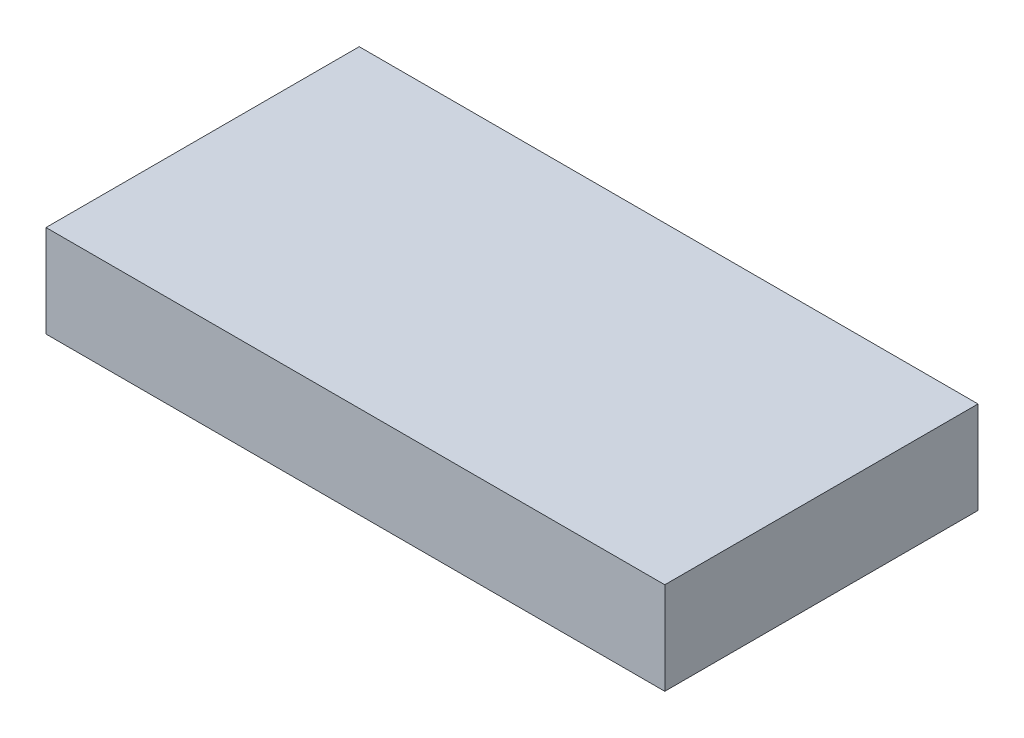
from build123d import *

# Parameters (mm, degrees)
REVOLVE1_ANGLE      = 180
SKETCH2_W           = 69
SKETCH2_H           = 69.85
BOSS_EXTRUDE1_DEPTH = 3
SKETCH3_W           = 69
SKETCH3_H           = 69.85
SKETCH3_W_2         = 63
SKETCH3_H_2         = 63.85
BOSS_EXTRUDE2_DEPTH = 17.58
SKETCH7_R           = 2.761950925
BOSS_EXTRUDE5_DEPTH = 4.84
REVOLVE3_ANGLE      = 180


with BuildPart() as part:
    # Sketch1 → Revolve1 (revolve)
    with BuildSketch(Plane(origin=(0, 0, 0), x_dir=(1, 0, 0), z_dir=(0, 1, 0))):
        with BuildLine():
            Line((0, 59.182), (5, 59.182))
            Line((5, 59.182), (5, 44.182))
            Line((5, 44.182), (10, 44.182))
            ThreePointArc((10, 44.182), (12.296101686, 40.344303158), (10.603605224, 36.204803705))
            ThreePointArc((10.603605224, 36.204803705), (9.384128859, 27.022580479), (10.603605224, 17.840357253))
            ThreePointArc((10.603605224, 17.840357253), (10.512537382, 16.375395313), (10, 15))
            Line((10, 15), (5, 15))
            Line((5, 15), (5, 0))
            Line((5, 0), (0, 0))
            Line((0, 0), (0, 59.182))
        make_face()
    revolve(axis=Axis((0, 0, 0), (0, 0, -1)), revolution_arc=REVOLVE1_ANGLE)

    # Sketch2 → Boss-Extrude1 (add)
    with BuildSketch(Plane(origin=(0, 0, 0), x_dir=(1, 0, 0), z_dir=(0, 1, 0))):
        with Locations((0, 29.591)):
            Rectangle(SKETCH2_W, SKETCH2_H)
    extrude(amount=BOSS_EXTRUDE1_DEPTH)

    # Sketch3 → Boss-Extrude2 (add)
    with BuildSketch(Plane.XZ):
        with Locations((0, -29.591)):
            Rectangle(SKETCH3_W, SKETCH3_H)
        with Locations((0, -29.591)):
            Rectangle(SKETCH3_W_2, SKETCH3_H_2, mode=Mode.SUBTRACT)
    extrude(amount=BOSS_EXTRUDE2_DEPTH)

    # Sketch7 → Boss-Extrude5 (add)
    with BuildSketch(Plane.XY):
        Circle(SKETCH7_R)
    extrude(amount=BOSS_EXTRUDE5_DEPTH)

    # Mirror3: part across plane


with BuildPart() as part_1:
    add(part.part)
    add(part.part.mirror(Plane(origin=(34.5, 3, -64.516), x_dir=(0, 0, 1), z_dir=(-1, 0, 0))))

    # Sketch13 → Revolve3 (revolve)
    with BuildSketch(Plane.XZ):
        with BuildLine():
            Line((-23.5, -2.666), (-23.5, -7.666))
            ThreePointArc((-23.5, -7.666), (-21, -5.166), (-23.5, -2.666))
        make_face()
    revolve(axis=Axis((-23.5, 0, -2.666), (0, 0, -1)), revolution_arc=REVOLVE3_ANGLE)

    # Sketch14 → Revolve6 (revolve)
    with BuildSketch(Plane.XZ):
        with BuildLine():
            Line((23.5, -2.666), (23.5, -7.666))
            ThreePointArc((23.5, -7.666), (21, -5.166), (23.5, -2.666))
        make_face()
    revolve(axis=Axis((23.5, 0, -2.666), (0, 0, -1)))

    # Sketch15 → Revolve7 (revolve)
    with BuildSketch(Plane.XZ):
        with BuildLine():
            Line((-23.5, -51.516), (-23.5, -56.516))
            ThreePointArc((-23.5, -56.516), (-21, -54.016), (-23.5, -51.516))
        make_face()
    revolve(axis=Axis((-23.5, 0, -51.516), (0, 0, -1)))

    # Sketch16 → Revolve8 (revolve)
    with BuildSketch(Plane.XZ):
        with BuildLine():
            Line((23.5, -51.516), (23.5, -56.516))
            ThreePointArc((23.5, -56.516), (21, -54.016), (23.5, -51.516))
        make_face()
    revolve(axis=Axis((23.5, 0, -51.516), (0, 0, -1)))

    # Sketch17 → Cut-Revolve2 (revolve, cut)
    with BuildSketch(Plane.XZ):
        with BuildLine():
            Line((45.5, -7.666), (45.5, -2.666))
            ThreePointArc((45.5, -2.666), (48, -5.166), (45.5, -7.666))
        make_face()
    revolve(axis=Axis((45.5, 0, -7.666), (0, 0, 1)), mode=Mode.SUBTRACT)

    # Sketch18 → Cut-Revolve3 (revolve, cut)
    with BuildSketch(Plane.XZ):
        with BuildLine():
            Line((92.5, -7.666), (92.5, -2.666))
            ThreePointArc((92.5, -2.666), (90, -5.166), (92.5, -7.666))
        make_face()
    revolve(axis=Axis((92.5, 0, -7.666), (0, 0, 1)), mode=Mode.SUBTRACT)

    # Sketch19 → Cut-Revolve4 (revolve, cut)
    with BuildSketch(Plane.XZ):
        with BuildLine():
            Line((45.5, -56.516), (45.5, -51.516))
            ThreePointArc((45.5, -51.516), (48, -54.016), (45.5, -56.516))
        make_face()
    revolve(axis=Axis((45.5, 0, -56.516), (0, 0, 1)), mode=Mode.SUBTRACT)

    # Sketch20 → Cut-Revolve5 (revolve, cut)
    with BuildSketch(Plane.XZ):
        with BuildLine():
            Line((92.5, -51.516), (92.5, -56.516))
            ThreePointArc((92.5, -56.516), (90, -54.016), (92.5, -51.516))
        make_face()
    revolve(axis=Axis((92.5, 0, -51.516), (0, 0, -1)), mode=Mode.SUBTRACT)


solid = part_1.part
